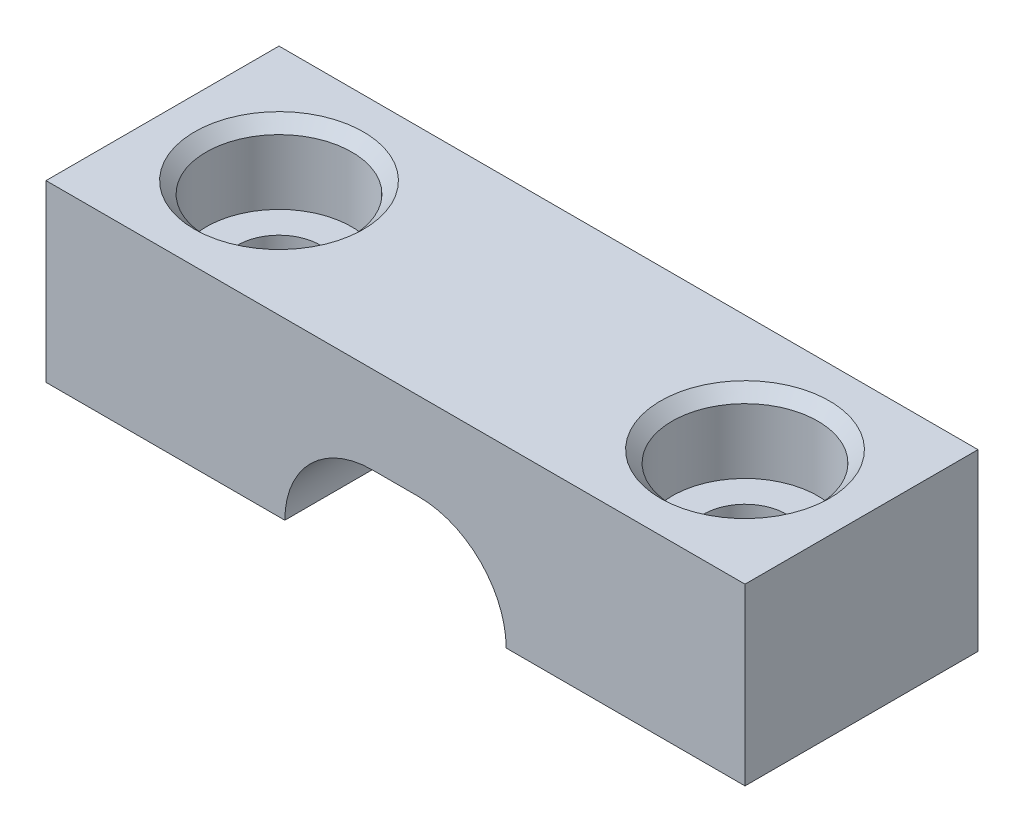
from build123d import *

# Parameters (mm, degrees)
EXTRUDE1_DEPTH                                = 12.7
CBORE_FOR_8_SOCKET_HEAD_CAP_SCREW1_AT_2_COUNT = 2
CBORE_FOR_8_SOCKET_HEAD_CAP_SCREW1_AT_2_PITCH = 25.4


with BuildPart() as part:
    # Sketch1 → Extrude1 (new body)
    with BuildSketch(Plane.XY):
        with BuildLine():
            Line((25.0825, 0), (38.1, 0))
            Line((38.1, 0), (38.1, 9.525))
            Line((38.1, 9.525), (0, 9.525))
            Line((0, 9.525), (0, 0))
            Line((0, 0), (13.0175, 0))
            ThreePointArc((13.0175, 0), (14.412403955, 3.367596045), (17.78, 4.7625))
            Line((17.78, 4.7625), (20.32, 4.7625))
            ThreePointArc((20.32, 4.7625), (23.687596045, 3.367596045), (25.0825, 0))
        make_face()
    extrude(amount=EXTRUDE1_DEPTH)

    # Sketch2 → CBORE for _8 Socket Head Cap Screw1 (revolve, cut)
    with BuildSketch(Plane(origin=(6.35, 9.525, 6.35), x_dir=(0, 0, 1), z_dir=(1, 0, 0))):
        Polygon((0, 0), (0, 9.525), (2.2479, 9.525), (2.2479, 4.1656), (3.96875, 4.1656), (3.96875, 0.635), (4.60375, 0), align=None)
    cbore_for_8_socket_head_cap_screw1 = revolve(axis=Axis((6.35, 15.875, 6.35), (0, -1, 0)), mode=Mode.SUBTRACT)

    # CBORE for _8 Socket Head Cap Screw1 at 2: CBORE for _8 Socket Head Cap Screw1 ×2
    with Locations(*[(i * CBORE_FOR_8_SOCKET_HEAD_CAP_SCREW1_AT_2_PITCH, 0, 0) for i in range(1, CBORE_FOR_8_SOCKET_HEAD_CAP_SCREW1_AT_2_COUNT)]):
        add(cbore_for_8_socket_head_cap_screw1, mode=Mode.SUBTRACT)


solid = part.part
